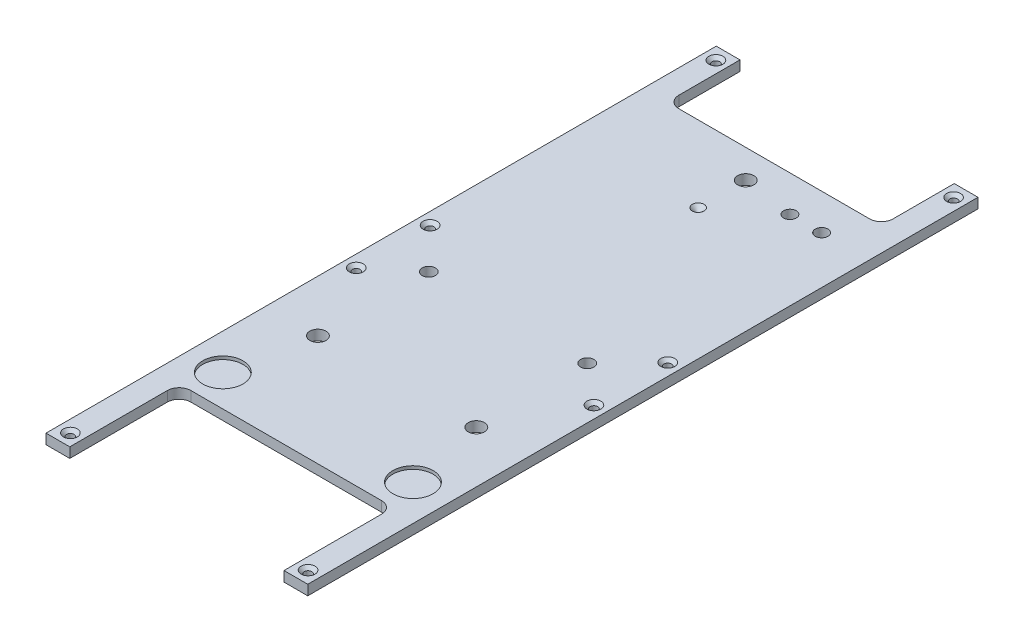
ISO-10303-21;
HEADER;
FILE_DESCRIPTION(('STEP AP214'),'2;1');
FILE_NAME('part.step','',(''),(''),'','','');
FILE_SCHEMA(('AUTOMOTIVE_DESIGN { 1 0 10303 214 1 1 1 1 }'));
ENDSEC;
DATA;
#1=APPLICATION_CONTEXT('core data for automotive mechanical design processes');
#2=APPLICATION_PROTOCOL_DEFINITION('international standard','automotive_design',2000,#1);
#3=PRODUCT_CONTEXT('',#1,'mechanical');
#4=PRODUCT('Part','Part','',(#3));
#5=PRODUCT_RELATED_PRODUCT_CATEGORY('part','',(#4));
#6=PRODUCT_DEFINITION_FORMATION('','',#4);
#7=PRODUCT_DEFINITION_CONTEXT('part definition',#1,'design');
#8=PRODUCT_DEFINITION('design','',#6,#7);
#9=PRODUCT_DEFINITION_SHAPE('','',#8);
#10=(LENGTH_UNIT() NAMED_UNIT(*) SI_UNIT(.MILLI.,.METRE.));
#11=(NAMED_UNIT(*) PLANE_ANGLE_UNIT() SI_UNIT($,.RADIAN.));
#12=(NAMED_UNIT(*) SI_UNIT($,.STERADIAN.) SOLID_ANGLE_UNIT());
#13=UNCERTAINTY_MEASURE_WITH_UNIT(LENGTH_MEASURE(1.E-05),#10,'distance_accuracy_value','');
#14=(GEOMETRIC_REPRESENTATION_CONTEXT(3) GLOBAL_UNCERTAINTY_ASSIGNED_CONTEXT((#13)) GLOBAL_UNIT_ASSIGNED_CONTEXT((#10,
#11,#12)) REPRESENTATION_CONTEXT('',''));
#15=CARTESIAN_POINT('',(0.,0.,0.));
#16=DIRECTION('',(0.,0.,1.));
#17=DIRECTION('',(1.,0.,0.));
#18=AXIS2_PLACEMENT_3D('',#15,#16,#17);
#19=CARTESIAN_POINT('',(0.,3.175,0.));
#20=DIRECTION('',(0.,1.,0.));
#21=DIRECTION('',(0.,0.,1.));
#22=AXIS2_PLACEMENT_3D('',#19,#20,#21);
#23=PLANE('',#22);
#24=CARTESIAN_POINT('',(16.3,3.175,-12.65));
#25=DIRECTION('',(0.,1.,0.));
#26=DIRECTION('',(0.,0.,1.));
#27=AXIS2_PLACEMENT_3D('',#24,#25,#26);
#28=CIRCLE('',#27,2.);
#29=CARTESIAN_POINT('',(16.3,3.175,-10.65));
#30=VERTEX_POINT('',#29);
#31=EDGE_CURVE('E456',#30,#30,#28,.T.);
#32=ORIENTED_EDGE('',*,*,#31,.F.);
#33=EDGE_LOOP('',(#32));
#34=FACE_BOUND('',#33,.T.);
#35=CARTESIAN_POINT('',(26.3,3.175,-12.65));
#36=DIRECTION('',(0.,1.,0.));
#37=DIRECTION('',(0.,0.,1.));
#38=AXIS2_PLACEMENT_3D('',#35,#36,#37);
#39=CIRCLE('',#38,2.);
#40=CARTESIAN_POINT('',(26.3,3.175,-10.65));
#41=VERTEX_POINT('',#40);
#42=EDGE_CURVE('E450',#41,#41,#39,.T.);
#43=ORIENTED_EDGE('',*,*,#42,.F.);
#44=EDGE_LOOP('',(#43));
#45=FACE_BOUND('',#44,.T.);
#46=CARTESIAN_POINT('',(-25.,3.175,60.));
#47=DIRECTION('',(0.,1.,0.));
#48=DIRECTION('',(0.,0.,1.));
#49=AXIS2_PLACEMENT_3D('',#46,#47,#48);
#50=CIRCLE('',#49,2.09999999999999);
#51=CARTESIAN_POINT('',(-25.,3.175,62.1));
#52=VERTEX_POINT('',#51);
#53=EDGE_CURVE('E444',#52,#52,#50,.T.);
#54=ORIENTED_EDGE('',*,*,#53,.F.);
#55=EDGE_LOOP('',(#54));
#56=FACE_BOUND('',#55,.T.);
#57=CARTESIAN_POINT('',(25.,3.175,60.));
#58=DIRECTION('',(0.,1.,0.));
#59=DIRECTION('',(0.,0.,1.));
#60=AXIS2_PLACEMENT_3D('',#57,#58,#59);
#61=CIRCLE('',#60,2.09999999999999);
#62=CARTESIAN_POINT('',(25.,3.175,62.1));
#63=VERTEX_POINT('',#62);
#64=EDGE_CURVE('E438',#63,#63,#61,.T.);
#65=ORIENTED_EDGE('',*,*,#64,.F.);
#66=EDGE_LOOP('',(#65));
#67=FACE_BOUND('',#66,.T.);
#68=CARTESIAN_POINT('',(-25.,3.175,95.));
#69=DIRECTION('',(0.,1.,0.));
#70=DIRECTION('',(0.,0.,1.));
#71=AXIS2_PLACEMENT_3D('',#68,#69,#70);
#72=CIRCLE('',#71,2.5527);
#73=CARTESIAN_POINT('',(-25.,3.175,97.5527));
#74=VERTEX_POINT('',#73);
#75=EDGE_CURVE('E432',#74,#74,#72,.T.);
#76=ORIENTED_EDGE('',*,*,#75,.F.);
#77=EDGE_LOOP('',(#76));
#78=FACE_BOUND('',#77,.T.);
#79=CARTESIAN_POINT('',(25.,3.175,95.));
#80=DIRECTION('',(0.,1.,0.));
#81=DIRECTION('',(0.,0.,1.));
#82=AXIS2_PLACEMENT_3D('',#79,#80,#81);
#83=CIRCLE('',#82,2.5527);
#84=CARTESIAN_POINT('',(25.,3.175,97.5527));
#85=VERTEX_POINT('',#84);
#86=EDGE_CURVE('E426',#85,#85,#83,.T.);
#87=ORIENTED_EDGE('',*,*,#86,.F.);
#88=EDGE_LOOP('',(#87));
#89=FACE_BOUND('',#88,.T.);
#90=CARTESIAN_POINT('',(0.,3.175,-15.));
#91=DIRECTION('',(0.,1.,0.));
#92=DIRECTION('',(0.,0.,1.));
#93=AXIS2_PLACEMENT_3D('',#90,#91,#92);
#94=CIRCLE('',#93,2.5527);
#95=CARTESIAN_POINT('',(0.,3.175,-12.4473));
#96=VERTEX_POINT('',#95);
#97=EDGE_CURVE('E420',#96,#96,#94,.T.);
#98=ORIENTED_EDGE('',*,*,#97,.F.);
#99=EDGE_LOOP('',(#98));
#100=FACE_BOUND('',#99,.T.);
#101=CARTESIAN_POINT('',(30.,3.175,120.));
#102=DIRECTION('',(0.,1.,0.));
#103=DIRECTION('',(0.,0.,1.));
#104=AXIS2_PLACEMENT_3D('',#101,#102,#103);
#105=CIRCLE('',#104,6.35000000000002);
#106=CARTESIAN_POINT('',(30.,3.175,126.35));
#107=VERTEX_POINT('',#106);
#108=EDGE_CURVE('E412',#107,#107,#105,.T.);
#109=ORIENTED_EDGE('',*,*,#108,.F.);
#110=EDGE_LOOP('',(#109));
#111=FACE_BOUND('',#110,.T.);
#112=CARTESIAN_POINT('',(-30.,3.175,120.));
#113=DIRECTION('',(0.,1.,0.));
#114=DIRECTION('',(0.,0.,1.));
#115=AXIS2_PLACEMENT_3D('',#112,#113,#114);
#116=CIRCLE('',#115,6.35000000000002);
#117=CARTESIAN_POINT('',(-30.,3.175,126.35));
#118=VERTEX_POINT('',#117);
#119=EDGE_CURVE('E406',#118,#118,#116,.T.);
#120=ORIENTED_EDGE('',*,*,#119,.F.);
#121=EDGE_LOOP('',(#120));
#122=FACE_BOUND('',#121,.T.);
#123=CARTESIAN_POINT('',(-37.4999999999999,3.175,-43.1));
#124=DIRECTION('',(0.,1.,0.));
#125=DIRECTION('',(0.,0.,1.));
#126=AXIS2_PLACEMENT_3D('',#123,#124,#125);
#127=CIRCLE('',#126,2.2);
#128=CARTESIAN_POINT('',(-37.4999999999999,3.175,-40.9));
#129=VERTEX_POINT('',#128);
#130=EDGE_CURVE('E402',#129,#129,#127,.T.);
#131=ORIENTED_EDGE('',*,*,#130,.F.);
#132=EDGE_LOOP('',(#131));
#133=FACE_BOUND('',#132,.T.);
#134=CARTESIAN_POINT('',(37.4999999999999,3.175,-43.1));
#135=DIRECTION('',(0.,1.,0.));
#136=DIRECTION('',(0.,0.,1.));
#137=AXIS2_PLACEMENT_3D('',#134,#135,#136);
#138=CIRCLE('',#137,2.2);
#139=CARTESIAN_POINT('',(37.4999999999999,3.175,-40.9));
#140=VERTEX_POINT('',#139);
#141=EDGE_CURVE('E393',#140,#140,#138,.T.);
#142=ORIENTED_EDGE('',*,*,#141,.F.);
#143=EDGE_LOOP('',(#142));
#144=FACE_BOUND('',#143,.T.);
#145=CARTESIAN_POINT('',(37.4999999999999,3.175,47.1));
#146=DIRECTION('',(0.,1.,0.));
#147=DIRECTION('',(0.,0.,1.));
#148=AXIS2_PLACEMENT_3D('',#145,#146,#147);
#149=CIRCLE('',#148,2.2);
#150=CARTESIAN_POINT('',(37.4999999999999,3.175,49.3));
#151=VERTEX_POINT('',#150);
#152=EDGE_CURVE('E384',#151,#151,#149,.T.);
#153=ORIENTED_EDGE('',*,*,#152,.F.);
#154=EDGE_LOOP('',(#153));
#155=FACE_BOUND('',#154,.T.);
#156=CARTESIAN_POINT('',(-37.4999999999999,3.175,47.1));
#157=DIRECTION('',(0.,1.,0.));
#158=DIRECTION('',(0.,0.,1.));
#159=AXIS2_PLACEMENT_3D('',#156,#157,#158);
#160=CIRCLE('',#159,2.2);
#161=CARTESIAN_POINT('',(-37.4999999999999,3.175,49.3));
#162=VERTEX_POINT('',#161);
#163=EDGE_CURVE('E375',#162,#162,#160,.T.);
#164=ORIENTED_EDGE('',*,*,#163,.F.);
#165=EDGE_LOOP('',(#164));
#166=FACE_BOUND('',#165,.T.);
#167=CARTESIAN_POINT('',(-37.4999999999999,3.175,70.4));
#168=DIRECTION('',(0.,1.,0.));
#169=DIRECTION('',(0.,0.,1.));
#170=AXIS2_PLACEMENT_3D('',#167,#168,#169);
#171=CIRCLE('',#170,2.2);
#172=CARTESIAN_POINT('',(-37.4999999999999,3.175,72.6));
#173=VERTEX_POINT('',#172);
#174=EDGE_CURVE('E366',#173,#173,#171,.T.);
#175=ORIENTED_EDGE('',*,*,#174,.F.);
#176=EDGE_LOOP('',(#175));
#177=FACE_BOUND('',#176,.T.);
#178=CARTESIAN_POINT('',(37.4999999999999,3.175,70.4));
#179=DIRECTION('',(0.,1.,0.));
#180=DIRECTION('',(0.,0.,1.));
#181=AXIS2_PLACEMENT_3D('',#178,#179,#180);
#182=CIRCLE('',#181,2.2);
#183=CARTESIAN_POINT('',(37.4999999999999,3.175,72.6));
#184=VERTEX_POINT('',#183);
#185=EDGE_CURVE('E357',#184,#184,#182,.T.);
#186=ORIENTED_EDGE('',*,*,#185,.F.);
#187=EDGE_LOOP('',(#186));
#188=FACE_BOUND('',#187,.T.);
#189=CARTESIAN_POINT('',(-37.4999999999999,3.175,160.6));
#190=DIRECTION('',(0.,1.,0.));
#191=DIRECTION('',(0.,0.,1.));
#192=AXIS2_PLACEMENT_3D('',#189,#190,#191);
#193=CIRCLE('',#192,2.2);
#194=CARTESIAN_POINT('',(-37.4999999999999,3.175,162.8));
#195=VERTEX_POINT('',#194);
#196=EDGE_CURVE('E348',#195,#195,#193,.T.);
#197=ORIENTED_EDGE('',*,*,#196,.F.);
#198=EDGE_LOOP('',(#197));
#199=FACE_BOUND('',#198,.T.);
#200=CARTESIAN_POINT('',(37.5000000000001,3.175,160.6));
#201=DIRECTION('',(0.,1.,0.));
#202=DIRECTION('',(0.,0.,1.));
#203=AXIS2_PLACEMENT_3D('',#200,#201,#202);
#204=CIRCLE('',#203,2.2);
#205=CARTESIAN_POINT('',(37.5000000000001,3.175,162.8));
#206=VERTEX_POINT('',#205);
#207=EDGE_CURVE('E339',#206,#206,#204,.T.);
#208=ORIENTED_EDGE('',*,*,#207,.F.);
#209=EDGE_LOOP('',(#208));
#210=FACE_BOUND('',#209,.T.);
#211=DIRECTION('',(0.,0.,-1.));
#212=VECTOR('',#211,1.);
#213=CARTESIAN_POINT('',(41.3,3.175,-24.));
#214=LINE('',#213,#212);
#215=CARTESIAN_POINT('',(41.3,3.175,164.5));
#216=VERTEX_POINT('',#215);
#217=CARTESIAN_POINT('',(41.3,3.175,-47.));
#218=VERTEX_POINT('',#217);
#219=EDGE_CURVE('E258',#216,#218,#214,.T.);
#220=ORIENTED_EDGE('',*,*,#219,.T.);
#221=DIRECTION('',(1.,0.,0.));
#222=VECTOR('',#221,1.);
#223=CARTESIAN_POINT('',(33.8,3.175,-47.));
#224=LINE('',#223,#222);
#225=CARTESIAN_POINT('',(33.8,3.175,-47.));
#226=VERTEX_POINT('',#225);
#227=EDGE_CURVE('E288',#226,#218,#224,.T.);
#228=ORIENTED_EDGE('',*,*,#227,.F.);
#229=DIRECTION('',(0.,0.,-1.));
#230=VECTOR('',#229,1.);
#231=CARTESIAN_POINT('',(33.8,3.175,-24.));
#232=LINE('',#231,#230);
#233=CARTESIAN_POINT('',(33.8,3.175,-27.7));
#234=VERTEX_POINT('',#233);
#235=EDGE_CURVE('E289',#234,#226,#232,.T.);
#236=ORIENTED_EDGE('',*,*,#235,.F.);
#237=CARTESIAN_POINT('',(30.1,3.175,-27.7));
#238=DIRECTION('',(0.,1.,0.));
#239=DIRECTION('',(0.,0.,1.));
#240=AXIS2_PLACEMENT_3D('',#237,#238,#239);
#241=CIRCLE('',#240,3.7);
#242=CARTESIAN_POINT('',(30.1,3.175,-24.));
#243=VERTEX_POINT('',#242);
#244=EDGE_CURVE('E11',#234,#243,#241,.F.);
#245=ORIENTED_EDGE('',*,*,#244,.T.);
#246=DIRECTION('',(-1.,0.,0.));
#247=VECTOR('',#246,1.);
#248=CARTESIAN_POINT('',(-41.3,3.175,-24.));
#249=LINE('',#248,#247);
#250=CARTESIAN_POINT('',(-30.1,3.175,-24.));
#251=VERTEX_POINT('',#250);
#252=EDGE_CURVE('E241',#243,#251,#249,.T.);
#253=ORIENTED_EDGE('',*,*,#252,.T.);
#254=CARTESIAN_POINT('',(-30.1,3.175,-27.7));
#255=DIRECTION('',(0.,1.,0.));
#256=DIRECTION('',(0.,0.,1.));
#257=AXIS2_PLACEMENT_3D('',#254,#255,#256);
#258=CIRCLE('',#257,3.7);
#259=CARTESIAN_POINT('',(-33.8,3.175,-27.7));
#260=VERTEX_POINT('',#259);
#261=EDGE_CURVE('E211',#251,#260,#258,.F.);
#262=ORIENTED_EDGE('',*,*,#261,.T.);
#263=DIRECTION('',(0.,0.,1.));
#264=VECTOR('',#263,1.);
#265=CARTESIAN_POINT('',(-33.8,3.175,-47.));
#266=LINE('',#265,#264);
#267=CARTESIAN_POINT('',(-33.8,3.175,-47.));
#268=VERTEX_POINT('',#267);
#269=EDGE_CURVE('E278',#268,#260,#266,.T.);
#270=ORIENTED_EDGE('',*,*,#269,.F.);
#271=DIRECTION('',(1.,0.,0.));
#272=VECTOR('',#271,1.);
#273=CARTESIAN_POINT('',(-41.3,3.175,-47.));
#274=LINE('',#273,#272);
#275=CARTESIAN_POINT('',(-41.3,3.175,-47.));
#276=VERTEX_POINT('',#275);
#277=EDGE_CURVE('E275',#276,#268,#274,.T.);
#278=ORIENTED_EDGE('',*,*,#277,.F.);
#279=DIRECTION('',(0.,0.,1.));
#280=VECTOR('',#279,1.);
#281=CARTESIAN_POINT('',(-41.3,3.175,-24.));
#282=LINE('',#281,#280);
#283=CARTESIAN_POINT('',(-41.3,3.175,164.5));
#284=VERTEX_POINT('',#283);
#285=EDGE_CURVE('E264',#276,#284,#282,.T.);
#286=ORIENTED_EDGE('',*,*,#285,.T.);
#287=DIRECTION('',(-1.,0.,0.));
#288=VECTOR('',#287,1.);
#289=CARTESIAN_POINT('',(-41.3,3.175,164.5));
#290=LINE('',#289,#288);
#291=CARTESIAN_POINT('',(-33.8,3.175,164.5));
#292=VERTEX_POINT('',#291);
#293=EDGE_CURVE('E304',#292,#284,#290,.T.);
#294=ORIENTED_EDGE('',*,*,#293,.F.);
#295=DIRECTION('',(0.,0.,1.));
#296=VECTOR('',#295,1.);
#297=CARTESIAN_POINT('',(-33.8,3.175,130.));
#298=LINE('',#297,#296);
#299=CARTESIAN_POINT('',(-33.8,3.175,133.7));
#300=VERTEX_POINT('',#299);
#301=EDGE_CURVE('E305',#300,#292,#298,.T.);
#302=ORIENTED_EDGE('',*,*,#301,.F.);
#303=CARTESIAN_POINT('',(-30.1,3.175,133.7));
#304=DIRECTION('',(0.,1.,0.));
#305=DIRECTION('',(0.,0.,1.));
#306=AXIS2_PLACEMENT_3D('',#303,#304,#305);
#307=CIRCLE('',#306,3.7);
#308=CARTESIAN_POINT('',(-30.1,3.175,130.));
#309=VERTEX_POINT('',#308);
#310=EDGE_CURVE('E220',#300,#309,#307,.F.);
#311=ORIENTED_EDGE('',*,*,#310,.T.);
#312=DIRECTION('',(1.,0.,0.));
#313=VECTOR('',#312,1.);
#314=CARTESIAN_POINT('',(-41.3,3.175,130.));
#315=LINE('',#314,#313);
#316=CARTESIAN_POINT('',(30.1,3.175,130.));
#317=VERTEX_POINT('',#316);
#318=EDGE_CURVE('E261',#309,#317,#315,.T.);
#319=ORIENTED_EDGE('',*,*,#318,.T.);
#320=CARTESIAN_POINT('',(30.1,3.175,133.7));
#321=DIRECTION('',(0.,1.,0.));
#322=DIRECTION('',(0.,0.,1.));
#323=AXIS2_PLACEMENT_3D('',#320,#321,#322);
#324=CIRCLE('',#323,3.7);
#325=CARTESIAN_POINT('',(33.8,3.175,133.7));
#326=VERTEX_POINT('',#325);
#327=EDGE_CURVE('E226',#317,#326,#324,.F.);
#328=ORIENTED_EDGE('',*,*,#327,.T.);
#329=DIRECTION('',(0.,0.,-1.));
#330=VECTOR('',#329,1.);
#331=CARTESIAN_POINT('',(33.8,3.175,130.));
#332=LINE('',#331,#330);
#333=CARTESIAN_POINT('',(33.8,3.175,164.5));
#334=VERTEX_POINT('',#333);
#335=EDGE_CURVE('E317',#334,#326,#332,.T.);
#336=ORIENTED_EDGE('',*,*,#335,.F.);
#337=DIRECTION('',(-1.,0.,0.));
#338=VECTOR('',#337,1.);
#339=CARTESIAN_POINT('',(41.3,3.175,164.5));
#340=LINE('',#339,#338);
#341=EDGE_CURVE('E320',#216,#334,#340,.T.);
#342=ORIENTED_EDGE('',*,*,#341,.F.);
#343=EDGE_LOOP('',(#220,#228,#236,#245,#253,#262,#270,#278,#286,#294,#302,#311,#319,#328,#336,#342));
#344=FACE_BOUND('',#343,.T.);
#345=CARTESIAN_POINT('',(0.,3.17499999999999,0.));
#346=DIRECTION('',(0.,1.,0.));
#347=DIRECTION('',(-1.,0.,0.));
#348=AXIS2_PLACEMENT_3D('',#345,#346,#347);
#349=CIRCLE('',#348,1.85000000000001);
#350=CARTESIAN_POINT('',(-1.85000000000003,3.17499999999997,0.));
#351=VERTEX_POINT('',#350);
#352=EDGE_CURVE('E329',#351,#351,#349,.T.);
#353=ORIENTED_EDGE('',*,*,#352,.F.);
#354=EDGE_LOOP('',(#353));
#355=FACE_BOUND('',#354,.T.);
#356=ADVANCED_FACE('F37',(#34,#45,#56,#67,#78,#89,#100,#111,#122,#133,#144,#155,#166,#177,#188,
#199,#210,#344,#355),#23,.T.);
#357=CARTESIAN_POINT('',(-41.3,3.175,-24.));
#358=DIRECTION('',(0.,0.,1.));
#359=DIRECTION('',(1.,0.,0.));
#360=AXIS2_PLACEMENT_3D('',#357,#358,#359);
#361=PLANE('',#360);
#362=DIRECTION('',(-1.,0.,0.));
#363=VECTOR('',#362,1.);
#364=CARTESIAN_POINT('',(-41.3,0.,-24.));
#365=LINE('',#364,#363);
#366=CARTESIAN_POINT('',(30.1,0.,-24.));
#367=VERTEX_POINT('',#366);
#368=CARTESIAN_POINT('',(-30.1,0.,-24.));
#369=VERTEX_POINT('',#368);
#370=EDGE_CURVE('E235',#367,#369,#365,.T.);
#371=ORIENTED_EDGE('',*,*,#370,.T.);
#372=DIRECTION('',(0.,-1.,0.));
#373=VECTOR('',#372,1.);
#374=CARTESIAN_POINT('',(-30.1,3.175,-24.));
#375=LINE('',#374,#373);
#376=EDGE_CURVE('E212',#369,#251,#375,.F.);
#377=ORIENTED_EDGE('',*,*,#376,.T.);
#378=ORIENTED_EDGE('',*,*,#252,.F.);
#379=DIRECTION('',(0.,-1.,0.));
#380=VECTOR('',#379,1.);
#381=CARTESIAN_POINT('',(30.1,3.175,-24.));
#382=LINE('',#381,#380);
#383=EDGE_CURVE('E232',#243,#367,#382,.T.);
#384=ORIENTED_EDGE('',*,*,#383,.T.);
#385=EDGE_LOOP('',(#371,#377,#378,#384));
#386=FACE_BOUND('',#385,.T.);
#387=ADVANCED_FACE('F166',(#386),#361,.F.);
#388=CARTESIAN_POINT('',(41.3,3.175,-24.));
#389=DIRECTION('',(-1.,0.,0.));
#390=DIRECTION('',(0.,0.,1.));
#391=AXIS2_PLACEMENT_3D('',#388,#389,#390);
#392=PLANE('',#391);
#393=DIRECTION('',(0.,0.,-1.));
#394=VECTOR('',#393,1.);
#395=CARTESIAN_POINT('',(41.3,0.,-24.));
#396=LINE('',#395,#394);
#397=CARTESIAN_POINT('',(41.3,0.,164.5));
#398=VERTEX_POINT('',#397);
#399=CARTESIAN_POINT('',(41.3,0.,-47.));
#400=VERTEX_POINT('',#399);
#401=EDGE_CURVE('E240',#398,#400,#396,.T.);
#402=ORIENTED_EDGE('',*,*,#401,.T.);
#403=DIRECTION('',(0.,-1.,0.));
#404=VECTOR('',#403,1.);
#405=CARTESIAN_POINT('',(41.3,38.4808068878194,-47.));
#406=LINE('',#405,#404);
#407=EDGE_CURVE('E284',#218,#400,#406,.T.);
#408=ORIENTED_EDGE('',*,*,#407,.F.);
#409=ORIENTED_EDGE('',*,*,#219,.F.);
#410=DIRECTION('',(0.,-1.,0.));
#411=VECTOR('',#410,1.);
#412=CARTESIAN_POINT('',(41.3,38.4808068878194,164.5));
#413=LINE('',#412,#411);
#414=EDGE_CURVE('E314',#216,#398,#413,.T.);
#415=ORIENTED_EDGE('',*,*,#414,.T.);
#416=EDGE_LOOP('',(#402,#408,#409,#415));
#417=FACE_BOUND('',#416,.T.);
#418=ADVANCED_FACE('F172',(#417),#392,.F.);
#419=CARTESIAN_POINT('',(-41.3,3.175,-24.));
#420=DIRECTION('',(1.,0.,0.));
#421=DIRECTION('',(0.,0.,-1.));
#422=AXIS2_PLACEMENT_3D('',#419,#420,#421);
#423=PLANE('',#422);
#424=DIRECTION('',(0.,0.,1.));
#425=VECTOR('',#424,1.);
#426=CARTESIAN_POINT('',(-41.3,0.,-24.));
#427=LINE('',#426,#425);
#428=CARTESIAN_POINT('',(-41.3,0.,-47.));
#429=VERTEX_POINT('',#428);
#430=CARTESIAN_POINT('',(-41.3,0.,164.5));
#431=VERTEX_POINT('',#430);
#432=EDGE_CURVE('E239',#429,#431,#427,.T.);
#433=ORIENTED_EDGE('',*,*,#432,.T.);
#434=DIRECTION('',(0.,-1.,0.));
#435=VECTOR('',#434,1.);
#436=CARTESIAN_POINT('',(-41.3,38.4808068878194,164.5));
#437=LINE('',#436,#435);
#438=EDGE_CURVE('E298',#284,#431,#437,.T.);
#439=ORIENTED_EDGE('',*,*,#438,.F.);
#440=ORIENTED_EDGE('',*,*,#285,.F.);
#441=DIRECTION('',(0.,-1.,0.));
#442=VECTOR('',#441,1.);
#443=CARTESIAN_POINT('',(-41.3,38.4808068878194,-47.));
#444=LINE('',#443,#442);
#445=EDGE_CURVE('E272',#276,#429,#444,.T.);
#446=ORIENTED_EDGE('',*,*,#445,.T.);
#447=EDGE_LOOP('',(#433,#439,#440,#446));
#448=FACE_BOUND('',#447,.T.);
#449=ADVANCED_FACE('F188',(#448),#423,.F.);
#450=CARTESIAN_POINT('',(-41.3,3.175,130.));
#451=DIRECTION('',(0.,0.,-1.));
#452=DIRECTION('',(-1.,0.,0.));
#453=AXIS2_PLACEMENT_3D('',#450,#451,#452);
#454=PLANE('',#453);
#455=DIRECTION('',(1.,0.,0.));
#456=VECTOR('',#455,1.);
#457=CARTESIAN_POINT('',(-41.3,0.,130.));
#458=LINE('',#457,#456);
#459=CARTESIAN_POINT('',(-30.1,0.,130.));
#460=VERTEX_POINT('',#459);
#461=CARTESIAN_POINT('',(30.1,0.,130.));
#462=VERTEX_POINT('',#461);
#463=EDGE_CURVE('E249',#460,#462,#458,.T.);
#464=ORIENTED_EDGE('',*,*,#463,.T.);
#465=DIRECTION('',(0.,-1.,0.));
#466=VECTOR('',#465,1.);
#467=CARTESIAN_POINT('',(30.1,3.175,130.));
#468=LINE('',#467,#466);
#469=EDGE_CURVE('E509',#462,#317,#468,.F.);
#470=ORIENTED_EDGE('',*,*,#469,.T.);
#471=ORIENTED_EDGE('',*,*,#318,.F.);
#472=DIRECTION('',(0.,-1.,0.));
#473=VECTOR('',#472,1.);
#474=CARTESIAN_POINT('',(-30.1,3.175,130.));
#475=LINE('',#474,#473);
#476=EDGE_CURVE('E265',#309,#460,#475,.T.);
#477=ORIENTED_EDGE('',*,*,#476,.T.);
#478=EDGE_LOOP('',(#464,#470,#471,#477));
#479=FACE_BOUND('',#478,.T.);
#480=ADVANCED_FACE('F184',(#479),#454,.F.);
#481=CARTESIAN_POINT('',(0.,0.,0.));
#482=DIRECTION('',(0.,1.,0.));
#483=DIRECTION('',(0.,0.,1.));
#484=AXIS2_PLACEMENT_3D('',#481,#482,#483);
#485=PLANE('',#484);
#486=CARTESIAN_POINT('',(16.3,0.,-12.65));
#487=DIRECTION('',(0.,1.,0.));
#488=DIRECTION('',(0.,0.,1.));
#489=AXIS2_PLACEMENT_3D('',#486,#487,#488);
#490=CIRCLE('',#489,2.);
#491=CARTESIAN_POINT('',(16.3,0.,-10.65));
#492=VERTEX_POINT('',#491);
#493=EDGE_CURVE('E453',#492,#492,#490,.F.);
#494=ORIENTED_EDGE('',*,*,#493,.F.);
#495=EDGE_LOOP('',(#494));
#496=FACE_BOUND('',#495,.T.);
#497=CARTESIAN_POINT('',(26.3,0.,-12.65));
#498=DIRECTION('',(0.,1.,0.));
#499=DIRECTION('',(0.,0.,1.));
#500=AXIS2_PLACEMENT_3D('',#497,#498,#499);
#501=CIRCLE('',#500,2.);
#502=CARTESIAN_POINT('',(26.3,0.,-10.65));
#503=VERTEX_POINT('',#502);
#504=EDGE_CURVE('E447',#503,#503,#501,.F.);
#505=ORIENTED_EDGE('',*,*,#504,.F.);
#506=EDGE_LOOP('',(#505));
#507=FACE_BOUND('',#506,.T.);
#508=CARTESIAN_POINT('',(-25.,0.,60.));
#509=DIRECTION('',(0.,1.,0.));
#510=DIRECTION('',(0.,0.,1.));
#511=AXIS2_PLACEMENT_3D('',#508,#509,#510);
#512=CIRCLE('',#511,2.1);
#513=CARTESIAN_POINT('',(-25.,0.,62.1));
#514=VERTEX_POINT('',#513);
#515=EDGE_CURVE('E441',#514,#514,#512,.T.);
#516=ORIENTED_EDGE('',*,*,#515,.T.);
#517=EDGE_LOOP('',(#516));
#518=FACE_BOUND('',#517,.T.);
#519=CARTESIAN_POINT('',(25.,0.,60.));
#520=DIRECTION('',(0.,1.,0.));
#521=DIRECTION('',(0.,0.,1.));
#522=AXIS2_PLACEMENT_3D('',#519,#520,#521);
#523=CIRCLE('',#522,2.1);
#524=CARTESIAN_POINT('',(25.,0.,62.1));
#525=VERTEX_POINT('',#524);
#526=EDGE_CURVE('E435',#525,#525,#523,.T.);
#527=ORIENTED_EDGE('',*,*,#526,.T.);
#528=EDGE_LOOP('',(#527));
#529=FACE_BOUND('',#528,.T.);
#530=CARTESIAN_POINT('',(-25.,0.,95.));
#531=DIRECTION('',(0.,1.,0.));
#532=DIRECTION('',(0.,0.,1.));
#533=AXIS2_PLACEMENT_3D('',#530,#531,#532);
#534=CIRCLE('',#533,2.5527);
#535=CARTESIAN_POINT('',(-25.,0.,97.5527));
#536=VERTEX_POINT('',#535);
#537=EDGE_CURVE('E429',#536,#536,#534,.T.);
#538=ORIENTED_EDGE('',*,*,#537,.T.);
#539=EDGE_LOOP('',(#538));
#540=FACE_BOUND('',#539,.T.);
#541=CARTESIAN_POINT('',(25.,0.,95.));
#542=DIRECTION('',(0.,1.,0.));
#543=DIRECTION('',(0.,0.,1.));
#544=AXIS2_PLACEMENT_3D('',#541,#542,#543);
#545=CIRCLE('',#544,2.5527);
#546=CARTESIAN_POINT('',(25.,0.,97.5527));
#547=VERTEX_POINT('',#546);
#548=EDGE_CURVE('E423',#547,#547,#545,.T.);
#549=ORIENTED_EDGE('',*,*,#548,.T.);
#550=EDGE_LOOP('',(#549));
#551=FACE_BOUND('',#550,.T.);
#552=CARTESIAN_POINT('',(0.,0.,-15.));
#553=DIRECTION('',(0.,1.,0.));
#554=DIRECTION('',(0.,0.,1.));
#555=AXIS2_PLACEMENT_3D('',#552,#553,#554);
#556=CIRCLE('',#555,2.5527);
#557=CARTESIAN_POINT('',(0.,0.,-12.4473));
#558=VERTEX_POINT('',#557);
#559=EDGE_CURVE('E415',#558,#558,#556,.T.);
#560=ORIENTED_EDGE('',*,*,#559,.T.);
#561=EDGE_LOOP('',(#560));
#562=FACE_BOUND('',#561,.T.);
#563=CARTESIAN_POINT('',(-37.4999999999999,0.,-43.1));
#564=DIRECTION('',(0.,1.,0.));
#565=DIRECTION('',(0.,0.,1.));
#566=AXIS2_PLACEMENT_3D('',#563,#564,#565);
#567=CIRCLE('',#566,1.2);
#568=CARTESIAN_POINT('',(-37.4999999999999,0.,-41.9));
#569=VERTEX_POINT('',#568);
#570=EDGE_CURVE('E396',#569,#569,#567,.T.);
#571=ORIENTED_EDGE('',*,*,#570,.T.);
#572=EDGE_LOOP('',(#571));
#573=FACE_BOUND('',#572,.T.);
#574=CARTESIAN_POINT('',(37.4999999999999,0.,-43.1));
#575=DIRECTION('',(0.,1.,0.));
#576=DIRECTION('',(0.,0.,1.));
#577=AXIS2_PLACEMENT_3D('',#574,#575,#576);
#578=CIRCLE('',#577,1.2);
#579=CARTESIAN_POINT('',(37.4999999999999,0.,-41.9));
#580=VERTEX_POINT('',#579);
#581=EDGE_CURVE('E387',#580,#580,#578,.T.);
#582=ORIENTED_EDGE('',*,*,#581,.T.);
#583=EDGE_LOOP('',(#582));
#584=FACE_BOUND('',#583,.T.);
#585=CARTESIAN_POINT('',(37.4999999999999,0.,47.1));
#586=DIRECTION('',(0.,1.,0.));
#587=DIRECTION('',(0.,0.,1.));
#588=AXIS2_PLACEMENT_3D('',#585,#586,#587);
#589=CIRCLE('',#588,1.2);
#590=CARTESIAN_POINT('',(37.4999999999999,0.,48.3));
#591=VERTEX_POINT('',#590);
#592=EDGE_CURVE('E378',#591,#591,#589,.T.);
#593=ORIENTED_EDGE('',*,*,#592,.T.);
#594=EDGE_LOOP('',(#593));
#595=FACE_BOUND('',#594,.T.);
#596=CARTESIAN_POINT('',(-37.4999999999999,0.,47.1));
#597=DIRECTION('',(0.,1.,0.));
#598=DIRECTION('',(0.,0.,1.));
#599=AXIS2_PLACEMENT_3D('',#596,#597,#598);
#600=CIRCLE('',#599,1.2);
#601=CARTESIAN_POINT('',(-37.4999999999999,0.,48.3));
#602=VERTEX_POINT('',#601);
#603=EDGE_CURVE('E369',#602,#602,#600,.T.);
#604=ORIENTED_EDGE('',*,*,#603,.T.);
#605=EDGE_LOOP('',(#604));
#606=FACE_BOUND('',#605,.T.);
#607=CARTESIAN_POINT('',(-37.4999999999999,0.,70.4));
#608=DIRECTION('',(0.,1.,0.));
#609=DIRECTION('',(0.,0.,1.));
#610=AXIS2_PLACEMENT_3D('',#607,#608,#609);
#611=CIRCLE('',#610,1.2);
#612=CARTESIAN_POINT('',(-37.4999999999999,0.,71.6));
#613=VERTEX_POINT('',#612);
#614=EDGE_CURVE('E360',#613,#613,#611,.T.);
#615=ORIENTED_EDGE('',*,*,#614,.T.);
#616=EDGE_LOOP('',(#615));
#617=FACE_BOUND('',#616,.T.);
#618=CARTESIAN_POINT('',(37.4999999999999,0.,70.4));
#619=DIRECTION('',(0.,1.,0.));
#620=DIRECTION('',(0.,0.,1.));
#621=AXIS2_PLACEMENT_3D('',#618,#619,#620);
#622=CIRCLE('',#621,1.2);
#623=CARTESIAN_POINT('',(37.4999999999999,0.,71.6));
#624=VERTEX_POINT('',#623);
#625=EDGE_CURVE('E351',#624,#624,#622,.T.);
#626=ORIENTED_EDGE('',*,*,#625,.T.);
#627=EDGE_LOOP('',(#626));
#628=FACE_BOUND('',#627,.T.);
#629=CARTESIAN_POINT('',(-37.4999999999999,0.,160.6));
#630=DIRECTION('',(0.,1.,0.));
#631=DIRECTION('',(0.,0.,1.));
#632=AXIS2_PLACEMENT_3D('',#629,#630,#631);
#633=CIRCLE('',#632,1.2);
#634=CARTESIAN_POINT('',(-37.4999999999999,0.,161.8));
#635=VERTEX_POINT('',#634);
#636=EDGE_CURVE('E342',#635,#635,#633,.T.);
#637=ORIENTED_EDGE('',*,*,#636,.T.);
#638=EDGE_LOOP('',(#637));
#639=FACE_BOUND('',#638,.T.);
#640=CARTESIAN_POINT('',(37.5000000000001,0.,160.6));
#641=DIRECTION('',(0.,1.,0.));
#642=DIRECTION('',(0.,0.,1.));
#643=AXIS2_PLACEMENT_3D('',#640,#641,#642);
#644=CIRCLE('',#643,1.2);
#645=CARTESIAN_POINT('',(37.5000000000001,0.,161.8));
#646=VERTEX_POINT('',#645);
#647=EDGE_CURVE('E333',#646,#646,#644,.T.);
#648=ORIENTED_EDGE('',*,*,#647,.T.);
#649=EDGE_LOOP('',(#648));
#650=FACE_BOUND('',#649,.T.);
#651=ORIENTED_EDGE('',*,*,#401,.F.);
#652=DIRECTION('',(-1.,0.,0.));
#653=VECTOR('',#652,1.);
#654=CARTESIAN_POINT('',(41.3,0.,164.5));
#655=LINE('',#654,#653);
#656=CARTESIAN_POINT('',(33.8,0.,164.5));
#657=VERTEX_POINT('',#656);
#658=EDGE_CURVE('E326',#398,#657,#655,.T.);
#659=ORIENTED_EDGE('',*,*,#658,.T.);
#660=DIRECTION('',(0.,0.,-1.));
#661=VECTOR('',#660,1.);
#662=CARTESIAN_POINT('',(33.8,0.,130.));
#663=LINE('',#662,#661);
#664=CARTESIAN_POINT('',(33.8,0.,133.7));
#665=VERTEX_POINT('',#664);
#666=EDGE_CURVE('E325',#657,#665,#663,.T.);
#667=ORIENTED_EDGE('',*,*,#666,.T.);
#668=CARTESIAN_POINT('',(30.1,0.,133.7));
#669=DIRECTION('',(0.,1.,0.));
#670=DIRECTION('',(0.,0.,1.));
#671=AXIS2_PLACEMENT_3D('',#668,#669,#670);
#672=CIRCLE('',#671,3.7);
#673=EDGE_CURVE('E228',#665,#462,#672,.T.);
#674=ORIENTED_EDGE('',*,*,#673,.T.);
#675=ORIENTED_EDGE('',*,*,#463,.F.);
#676=CARTESIAN_POINT('',(-30.1,0.,133.7));
#677=DIRECTION('',(0.,1.,0.));
#678=DIRECTION('',(0.,0.,1.));
#679=AXIS2_PLACEMENT_3D('',#676,#677,#678);
#680=CIRCLE('',#679,3.7);
#681=CARTESIAN_POINT('',(-33.8,0.,133.7));
#682=VERTEX_POINT('',#681);
#683=EDGE_CURVE('E224',#460,#682,#680,.T.);
#684=ORIENTED_EDGE('',*,*,#683,.T.);
#685=DIRECTION('',(0.,0.,1.));
#686=VECTOR('',#685,1.);
#687=CARTESIAN_POINT('',(-33.8,0.,130.));
#688=LINE('',#687,#686);
#689=CARTESIAN_POINT('',(-33.8,0.,164.5));
#690=VERTEX_POINT('',#689);
#691=EDGE_CURVE('E313',#682,#690,#688,.T.);
#692=ORIENTED_EDGE('',*,*,#691,.T.);
#693=DIRECTION('',(-1.,0.,0.));
#694=VECTOR('',#693,1.);
#695=CARTESIAN_POINT('',(-41.3,0.,164.5));
#696=LINE('',#695,#694);
#697=EDGE_CURVE('E310',#690,#431,#696,.T.);
#698=ORIENTED_EDGE('',*,*,#697,.T.);
#699=ORIENTED_EDGE('',*,*,#432,.F.);
#700=DIRECTION('',(1.,0.,0.));
#701=VECTOR('',#700,1.);
#702=CARTESIAN_POINT('',(-41.3,0.,-47.));
#703=LINE('',#702,#701);
#704=CARTESIAN_POINT('',(-33.8,0.,-47.));
#705=VERTEX_POINT('',#704);
#706=EDGE_CURVE('E281',#429,#705,#703,.T.);
#707=ORIENTED_EDGE('',*,*,#706,.T.);
#708=DIRECTION('',(0.,0.,1.));
#709=VECTOR('',#708,1.);
#710=CARTESIAN_POINT('',(-33.8,0.,-47.));
#711=LINE('',#710,#709);
#712=CARTESIAN_POINT('',(-33.8,0.,-27.7));
#713=VERTEX_POINT('',#712);
#714=EDGE_CURVE('E252',#705,#713,#711,.T.);
#715=ORIENTED_EDGE('',*,*,#714,.T.);
#716=CARTESIAN_POINT('',(-30.1,0.,-27.7));
#717=DIRECTION('',(0.,1.,0.));
#718=DIRECTION('',(0.,0.,1.));
#719=AXIS2_PLACEMENT_3D('',#716,#717,#718);
#720=CIRCLE('',#719,3.7);
#721=EDGE_CURVE('E218',#713,#369,#720,.T.);
#722=ORIENTED_EDGE('',*,*,#721,.T.);
#723=ORIENTED_EDGE('',*,*,#370,.F.);
#724=CARTESIAN_POINT('',(30.1,0.,-27.7));
#725=DIRECTION('',(0.,1.,0.));
#726=DIRECTION('',(0.,0.,1.));
#727=AXIS2_PLACEMENT_3D('',#724,#725,#726);
#728=CIRCLE('',#727,3.7);
#729=CARTESIAN_POINT('',(33.8,0.,-27.7));
#730=VERTEX_POINT('',#729);
#731=EDGE_CURVE('E45',#367,#730,#728,.T.);
#732=ORIENTED_EDGE('',*,*,#731,.T.);
#733=DIRECTION('',(0.,0.,-1.));
#734=VECTOR('',#733,1.);
#735=CARTESIAN_POINT('',(33.8,0.,-24.));
#736=LINE('',#735,#734);
#737=CARTESIAN_POINT('',(33.8,0.,-47.));
#738=VERTEX_POINT('',#737);
#739=EDGE_CURVE('E296',#730,#738,#736,.T.);
#740=ORIENTED_EDGE('',*,*,#739,.T.);
#741=DIRECTION('',(1.,0.,0.));
#742=VECTOR('',#741,1.);
#743=CARTESIAN_POINT('',(33.8,0.,-47.));
#744=LINE('',#743,#742);
#745=EDGE_CURVE('E293',#738,#400,#744,.T.);
#746=ORIENTED_EDGE('',*,*,#745,.T.);
#747=EDGE_LOOP('',(#651,#659,#667,#674,#675,#684,#692,#698,#699,#707,#715,#722,#723,#732,#740,#746));
#748=FACE_BOUND('',#747,.T.);
#749=ADVANCED_FACE('F181',(#496,#507,#518,#529,#540,#551,#562,#573,#584,#595,#606,#617,#628,
#639,#650,#748),#485,.F.);
#750=CARTESIAN_POINT('',(-41.3,38.4808068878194,-47.));
#751=DIRECTION('',(0.,0.,-1.));
#752=DIRECTION('',(-1.,0.,0.));
#753=AXIS2_PLACEMENT_3D('',#750,#751,#752);
#754=PLANE('',#753);
#755=ORIENTED_EDGE('',*,*,#445,.F.);
#756=ORIENTED_EDGE('',*,*,#277,.T.);
#757=DIRECTION('',(0.,-1.,0.));
#758=VECTOR('',#757,1.);
#759=CARTESIAN_POINT('',(-33.8,38.4808068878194,-47.));
#760=LINE('',#759,#758);
#761=EDGE_CURVE('E276',#268,#705,#760,.T.);
#762=ORIENTED_EDGE('',*,*,#761,.T.);
#763=ORIENTED_EDGE('',*,*,#706,.F.);
#764=EDGE_LOOP('',(#755,#756,#762,#763));
#765=FACE_BOUND('',#764,.T.);
#766=ADVANCED_FACE('F179',(#765),#754,.T.);
#767=CARTESIAN_POINT('',(-33.8,38.4808068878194,-47.));
#768=DIRECTION('',(1.,0.,0.));
#769=DIRECTION('',(0.,0.,-1.));
#770=AXIS2_PLACEMENT_3D('',#767,#768,#769);
#771=PLANE('',#770);
#772=ORIENTED_EDGE('',*,*,#269,.T.);
#773=DIRECTION('',(0.,-1.,0.));
#774=VECTOR('',#773,1.);
#775=CARTESIAN_POINT('',(-33.8,38.4808068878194,-27.7));
#776=LINE('',#775,#774);
#777=EDGE_CURVE('E214',#260,#713,#776,.T.);
#778=ORIENTED_EDGE('',*,*,#777,.T.);
#779=ORIENTED_EDGE('',*,*,#714,.F.);
#780=ORIENTED_EDGE('',*,*,#761,.F.);
#781=EDGE_LOOP('',(#772,#778,#779,#780));
#782=FACE_BOUND('',#781,.T.);
#783=ADVANCED_FACE('F525',(#782),#771,.T.);
#784=CARTESIAN_POINT('',(33.8,38.4808068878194,-24.));
#785=DIRECTION('',(-1.,0.,0.));
#786=DIRECTION('',(0.,0.,1.));
#787=AXIS2_PLACEMENT_3D('',#784,#785,#786);
#788=PLANE('',#787);
#789=ORIENTED_EDGE('',*,*,#739,.F.);
#790=DIRECTION('',(0.,-1.,0.));
#791=VECTOR('',#790,1.);
#792=CARTESIAN_POINT('',(33.8,38.4808068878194,-27.7));
#793=LINE('',#792,#791);
#794=EDGE_CURVE('E58',#730,#234,#793,.F.);
#795=ORIENTED_EDGE('',*,*,#794,.T.);
#796=ORIENTED_EDGE('',*,*,#235,.T.);
#797=DIRECTION('',(0.,-1.,0.));
#798=VECTOR('',#797,1.);
#799=CARTESIAN_POINT('',(33.8,38.4808068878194,-47.));
#800=LINE('',#799,#798);
#801=EDGE_CURVE('E285',#226,#738,#800,.T.);
#802=ORIENTED_EDGE('',*,*,#801,.T.);
#803=EDGE_LOOP('',(#789,#795,#796,#802));
#804=FACE_BOUND('',#803,.T.);
#805=ADVANCED_FACE('F550',(#804),#788,.T.);
#806=CARTESIAN_POINT('',(33.8,38.4808068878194,-47.));
#807=DIRECTION('',(0.,0.,-1.));
#808=DIRECTION('',(-1.,0.,0.));
#809=AXIS2_PLACEMENT_3D('',#806,#807,#808);
#810=PLANE('',#809);
#811=ORIENTED_EDGE('',*,*,#801,.F.);
#812=ORIENTED_EDGE('',*,*,#227,.T.);
#813=ORIENTED_EDGE('',*,*,#407,.T.);
#814=ORIENTED_EDGE('',*,*,#745,.F.);
#815=EDGE_LOOP('',(#811,#812,#813,#814));
#816=FACE_BOUND('',#815,.T.);
#817=ADVANCED_FACE('F552',(#816),#810,.T.);
#818=CARTESIAN_POINT('',(-33.8,38.4808068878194,130.));
#819=DIRECTION('',(1.,0.,0.));
#820=DIRECTION('',(0.,0.,-1.));
#821=AXIS2_PLACEMENT_3D('',#818,#819,#820);
#822=PLANE('',#821);
#823=ORIENTED_EDGE('',*,*,#691,.F.);
#824=DIRECTION('',(0.,-1.,0.));
#825=VECTOR('',#824,1.);
#826=CARTESIAN_POINT('',(-33.8,38.4808068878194,133.7));
#827=LINE('',#826,#825);
#828=EDGE_CURVE('E512',#682,#300,#827,.F.);
#829=ORIENTED_EDGE('',*,*,#828,.T.);
#830=ORIENTED_EDGE('',*,*,#301,.T.);
#831=DIRECTION('',(0.,-1.,0.));
#832=VECTOR('',#831,1.);
#833=CARTESIAN_POINT('',(-33.8,38.4808068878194,164.5));
#834=LINE('',#833,#832);
#835=EDGE_CURVE('E301',#292,#690,#834,.T.);
#836=ORIENTED_EDGE('',*,*,#835,.T.);
#837=EDGE_LOOP('',(#823,#829,#830,#836));
#838=FACE_BOUND('',#837,.T.);
#839=ADVANCED_FACE('F544',(#838),#822,.T.);
#840=CARTESIAN_POINT('',(-41.3,38.4808068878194,164.5));
#841=DIRECTION('',(0.,0.,1.));
#842=DIRECTION('',(1.,0.,0.));
#843=AXIS2_PLACEMENT_3D('',#840,#841,#842);
#844=PLANE('',#843);
#845=ORIENTED_EDGE('',*,*,#835,.F.);
#846=ORIENTED_EDGE('',*,*,#293,.T.);
#847=ORIENTED_EDGE('',*,*,#438,.T.);
#848=ORIENTED_EDGE('',*,*,#697,.F.);
#849=EDGE_LOOP('',(#845,#846,#847,#848));
#850=FACE_BOUND('',#849,.T.);
#851=ADVANCED_FACE('F538',(#850),#844,.T.);
#852=CARTESIAN_POINT('',(41.3,38.4808068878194,164.5));
#853=DIRECTION('',(0.,0.,1.));
#854=DIRECTION('',(1.,0.,0.));
#855=AXIS2_PLACEMENT_3D('',#852,#853,#854);
#856=PLANE('',#855);
#857=ORIENTED_EDGE('',*,*,#414,.F.);
#858=ORIENTED_EDGE('',*,*,#341,.T.);
#859=DIRECTION('',(0.,-1.,0.));
#860=VECTOR('',#859,1.);
#861=CARTESIAN_POINT('',(33.8,38.4808068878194,164.5));
#862=LINE('',#861,#860);
#863=EDGE_CURVE('E318',#334,#657,#862,.T.);
#864=ORIENTED_EDGE('',*,*,#863,.T.);
#865=ORIENTED_EDGE('',*,*,#658,.F.);
#866=EDGE_LOOP('',(#857,#858,#864,#865));
#867=FACE_BOUND('',#866,.T.);
#868=ADVANCED_FACE('F499',(#867),#856,.T.);
#869=CARTESIAN_POINT('',(33.8,38.4808068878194,130.));
#870=DIRECTION('',(-1.,0.,0.));
#871=DIRECTION('',(0.,0.,1.));
#872=AXIS2_PLACEMENT_3D('',#869,#870,#871);
#873=PLANE('',#872);
#874=ORIENTED_EDGE('',*,*,#335,.T.);
#875=DIRECTION('',(0.,-1.,0.));
#876=VECTOR('',#875,1.);
#877=CARTESIAN_POINT('',(33.8,38.4808068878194,133.7));
#878=LINE('',#877,#876);
#879=EDGE_CURVE('E259',#326,#665,#878,.T.);
#880=ORIENTED_EDGE('',*,*,#879,.T.);
#881=ORIENTED_EDGE('',*,*,#666,.F.);
#882=ORIENTED_EDGE('',*,*,#863,.F.);
#883=EDGE_LOOP('',(#874,#880,#881,#882));
#884=FACE_BOUND('',#883,.T.);
#885=ADVANCED_FACE('F200',(#884),#873,.T.);
#886=CARTESIAN_POINT('',(30.1,38.4808068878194,133.7));
#887=DIRECTION('',(0.,-1.,0.));
#888=DIRECTION('',(0.,0.,-1.));
#889=AXIS2_PLACEMENT_3D('',#886,#887,#888);
#890=CYLINDRICAL_SURFACE('',#889,3.7);
#891=ORIENTED_EDGE('',*,*,#327,.F.);
#892=ORIENTED_EDGE('',*,*,#469,.F.);
#893=ORIENTED_EDGE('',*,*,#673,.F.);
#894=ORIENTED_EDGE('',*,*,#879,.F.);
#895=EDGE_LOOP('',(#891,#892,#893,#894));
#896=FACE_BOUND('',#895,.T.);
#897=ADVANCED_FACE('F196',(#896),#890,.F.);
#898=CARTESIAN_POINT('',(-30.1,3.175,133.7));
#899=DIRECTION('',(0.,-1.,0.));
#900=DIRECTION('',(0.,0.,-1.));
#901=AXIS2_PLACEMENT_3D('',#898,#899,#900);
#902=CYLINDRICAL_SURFACE('',#901,3.7);
#903=ORIENTED_EDGE('',*,*,#310,.F.);
#904=ORIENTED_EDGE('',*,*,#828,.F.);
#905=ORIENTED_EDGE('',*,*,#683,.F.);
#906=ORIENTED_EDGE('',*,*,#476,.F.);
#907=EDGE_LOOP('',(#903,#904,#905,#906));
#908=FACE_BOUND('',#907,.T.);
#909=ADVANCED_FACE('F199',(#908),#902,.F.);
#910=CARTESIAN_POINT('',(-30.1,38.4808068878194,-27.7));
#911=DIRECTION('',(0.,-1.,0.));
#912=DIRECTION('',(0.,0.,-1.));
#913=AXIS2_PLACEMENT_3D('',#910,#911,#912);
#914=CYLINDRICAL_SURFACE('',#913,3.7);
#915=ORIENTED_EDGE('',*,*,#261,.F.);
#916=ORIENTED_EDGE('',*,*,#376,.F.);
#917=ORIENTED_EDGE('',*,*,#721,.F.);
#918=ORIENTED_EDGE('',*,*,#777,.F.);
#919=EDGE_LOOP('',(#915,#916,#917,#918));
#920=FACE_BOUND('',#919,.T.);
#921=ADVANCED_FACE('F161',(#920),#914,.F.);
#922=CARTESIAN_POINT('',(30.1,3.175,-27.7));
#923=DIRECTION('',(0.,-1.,0.));
#924=DIRECTION('',(0.,0.,-1.));
#925=AXIS2_PLACEMENT_3D('',#922,#923,#924);
#926=CYLINDRICAL_SURFACE('',#925,3.7);
#927=ORIENTED_EDGE('',*,*,#244,.F.);
#928=ORIENTED_EDGE('',*,*,#794,.F.);
#929=ORIENTED_EDGE('',*,*,#731,.F.);
#930=ORIENTED_EDGE('',*,*,#383,.F.);
#931=EDGE_LOOP('',(#927,#928,#929,#930));
#932=FACE_BOUND('',#931,.T.);
#933=ADVANCED_FACE('F39',(#932),#926,.F.);
#934=CARTESIAN_POINT('',(0.,1.325,0.));
#935=DIRECTION('',(0.,1.,0.));
#936=DIRECTION('',(-1.,0.,0.));
#937=AXIS2_PLACEMENT_3D('',#934,#935,#936);
#938=CONICAL_SURFACE('',#937,0.,0.785398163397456);
#939=ORIENTED_EDGE('',*,*,#352,.T.);
#940=EDGE_LOOP('',(#939));
#941=FACE_BOUND('',#940,.T.);
#942=CARTESIAN_POINT('',(0.,1.325,0.));
#943=VERTEX_POINT('',#942);
#944=VERTEX_LOOP('',#943);
#945=FACE_BOUND('',#944,.T.);
#946=ADVANCED_FACE('F149',(#941,#945),#938,.F.);
#947=CARTESIAN_POINT('',(37.5000000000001,3.175,160.6));
#948=DIRECTION('',(0.,1.,0.));
#949=DIRECTION('',(0.,0.,1.));
#950=AXIS2_PLACEMENT_3D('',#947,#948,#949);
#951=CYLINDRICAL_SURFACE('',#950,1.2);
#952=ORIENTED_EDGE('',*,*,#647,.F.);
#953=EDGE_LOOP('',(#952));
#954=FACE_BOUND('',#953,.T.);
#955=CARTESIAN_POINT('',(37.5000000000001,2.175,160.6));
#956=DIRECTION('',(0.,1.,0.));
#957=DIRECTION('',(0.,0.,1.));
#958=AXIS2_PLACEMENT_3D('',#955,#956,#957);
#959=CIRCLE('',#958,1.2);
#960=CARTESIAN_POINT('',(37.5000000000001,2.175,161.8));
#961=VERTEX_POINT('',#960);
#962=EDGE_CURVE('E336',#961,#961,#959,.T.);
#963=ORIENTED_EDGE('',*,*,#962,.T.);
#964=EDGE_LOOP('',(#963));
#965=FACE_BOUND('',#964,.T.);
#966=ADVANCED_FACE('F151',(#954,#965),#951,.F.);
#967=CARTESIAN_POINT('',(37.5000000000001,3.175,160.6));
#968=DIRECTION('',(0.,1.,0.));
#969=DIRECTION('',(0.,0.,1.));
#970=AXIS2_PLACEMENT_3D('',#967,#968,#969);
#971=CONICAL_SURFACE('',#970,2.2,0.785398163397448);
#972=ORIENTED_EDGE('',*,*,#962,.F.);
#973=EDGE_LOOP('',(#972));
#974=FACE_BOUND('',#973,.T.);
#975=ORIENTED_EDGE('',*,*,#207,.T.);
#976=EDGE_LOOP('',(#975));
#977=FACE_BOUND('',#976,.T.);
#978=ADVANCED_FACE('F158',(#974,#977),#971,.F.);
#979=CARTESIAN_POINT('',(-37.4999999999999,3.175,160.6));
#980=DIRECTION('',(0.,1.,0.));
#981=DIRECTION('',(0.,0.,1.));
#982=AXIS2_PLACEMENT_3D('',#979,#980,#981);
#983=CYLINDRICAL_SURFACE('',#982,1.2);
#984=ORIENTED_EDGE('',*,*,#636,.F.);
#985=EDGE_LOOP('',(#984));
#986=FACE_BOUND('',#985,.T.);
#987=CARTESIAN_POINT('',(-37.4999999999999,2.175,160.6));
#988=DIRECTION('',(0.,1.,0.));
#989=DIRECTION('',(0.,0.,1.));
#990=AXIS2_PLACEMENT_3D('',#987,#988,#989);
#991=CIRCLE('',#990,1.2);
#992=CARTESIAN_POINT('',(-37.4999999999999,2.175,161.8));
#993=VERTEX_POINT('',#992);
#994=EDGE_CURVE('E345',#993,#993,#991,.T.);
#995=ORIENTED_EDGE('',*,*,#994,.T.);
#996=EDGE_LOOP('',(#995));
#997=FACE_BOUND('',#996,.T.);
#998=ADVANCED_FACE('F672',(#986,#997),#983,.F.);
#999=CARTESIAN_POINT('',(-37.4999999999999,3.175,160.6));
#1000=DIRECTION('',(0.,1.,0.));
#1001=DIRECTION('',(0.,0.,1.));
#1002=AXIS2_PLACEMENT_3D('',#999,#1000,#1001);
#1003=CONICAL_SURFACE('',#1002,2.2,0.785398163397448);
#1004=ORIENTED_EDGE('',*,*,#994,.F.);
#1005=EDGE_LOOP('',(#1004));
#1006=FACE_BOUND('',#1005,.T.);
#1007=ORIENTED_EDGE('',*,*,#196,.T.);
#1008=EDGE_LOOP('',(#1007));
#1009=FACE_BOUND('',#1008,.T.);
#1010=ADVANCED_FACE('F682',(#1006,#1009),#1003,.F.);
#1011=CARTESIAN_POINT('',(37.4999999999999,3.175,70.4));
#1012=DIRECTION('',(0.,1.,0.));
#1013=DIRECTION('',(0.,0.,1.));
#1014=AXIS2_PLACEMENT_3D('',#1011,#1012,#1013);
#1015=CYLINDRICAL_SURFACE('',#1014,1.2);
#1016=ORIENTED_EDGE('',*,*,#625,.F.);
#1017=EDGE_LOOP('',(#1016));
#1018=FACE_BOUND('',#1017,.T.);
#1019=CARTESIAN_POINT('',(37.4999999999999,2.175,70.4));
#1020=DIRECTION('',(0.,1.,0.));
#1021=DIRECTION('',(0.,0.,1.));
#1022=AXIS2_PLACEMENT_3D('',#1019,#1020,#1021);
#1023=CIRCLE('',#1022,1.2);
#1024=CARTESIAN_POINT('',(37.4999999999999,2.175,71.6));
#1025=VERTEX_POINT('',#1024);
#1026=EDGE_CURVE('E354',#1025,#1025,#1023,.T.);
#1027=ORIENTED_EDGE('',*,*,#1026,.T.);
#1028=EDGE_LOOP('',(#1027));
#1029=FACE_BOUND('',#1028,.T.);
#1030=ADVANCED_FACE('F692',(#1018,#1029),#1015,.F.);
#1031=CARTESIAN_POINT('',(37.4999999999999,3.175,70.4));
#1032=DIRECTION('',(0.,1.,0.));
#1033=DIRECTION('',(0.,0.,1.));
#1034=AXIS2_PLACEMENT_3D('',#1031,#1032,#1033);
#1035=CONICAL_SURFACE('',#1034,2.2,0.785398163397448);
#1036=ORIENTED_EDGE('',*,*,#1026,.F.);
#1037=EDGE_LOOP('',(#1036));
#1038=FACE_BOUND('',#1037,.T.);
#1039=ORIENTED_EDGE('',*,*,#185,.T.);
#1040=EDGE_LOOP('',(#1039));
#1041=FACE_BOUND('',#1040,.T.);
#1042=ADVANCED_FACE('F702',(#1038,#1041),#1035,.F.);
#1043=CARTESIAN_POINT('',(-37.4999999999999,3.175,70.4));
#1044=DIRECTION('',(0.,1.,0.));
#1045=DIRECTION('',(0.,0.,1.));
#1046=AXIS2_PLACEMENT_3D('',#1043,#1044,#1045);
#1047=CYLINDRICAL_SURFACE('',#1046,1.2);
#1048=ORIENTED_EDGE('',*,*,#614,.F.);
#1049=EDGE_LOOP('',(#1048));
#1050=FACE_BOUND('',#1049,.T.);
#1051=CARTESIAN_POINT('',(-37.4999999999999,2.175,70.4));
#1052=DIRECTION('',(0.,1.,0.));
#1053=DIRECTION('',(0.,0.,1.));
#1054=AXIS2_PLACEMENT_3D('',#1051,#1052,#1053);
#1055=CIRCLE('',#1054,1.2);
#1056=CARTESIAN_POINT('',(-37.4999999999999,2.175,71.6));
#1057=VERTEX_POINT('',#1056);
#1058=EDGE_CURVE('E363',#1057,#1057,#1055,.T.);
#1059=ORIENTED_EDGE('',*,*,#1058,.T.);
#1060=EDGE_LOOP('',(#1059));
#1061=FACE_BOUND('',#1060,.T.);
#1062=ADVANCED_FACE('F712',(#1050,#1061),#1047,.F.);
#1063=CARTESIAN_POINT('',(-37.4999999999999,3.175,70.4));
#1064=DIRECTION('',(0.,1.,0.));
#1065=DIRECTION('',(0.,0.,1.));
#1066=AXIS2_PLACEMENT_3D('',#1063,#1064,#1065);
#1067=CONICAL_SURFACE('',#1066,2.2,0.785398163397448);
#1068=ORIENTED_EDGE('',*,*,#1058,.F.);
#1069=EDGE_LOOP('',(#1068));
#1070=FACE_BOUND('',#1069,.T.);
#1071=ORIENTED_EDGE('',*,*,#174,.T.);
#1072=EDGE_LOOP('',(#1071));
#1073=FACE_BOUND('',#1072,.T.);
#1074=ADVANCED_FACE('F722',(#1070,#1073),#1067,.F.);
#1075=CARTESIAN_POINT('',(-37.4999999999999,3.175,47.1));
#1076=DIRECTION('',(0.,1.,0.));
#1077=DIRECTION('',(0.,0.,1.));
#1078=AXIS2_PLACEMENT_3D('',#1075,#1076,#1077);
#1079=CYLINDRICAL_SURFACE('',#1078,1.2);
#1080=ORIENTED_EDGE('',*,*,#603,.F.);
#1081=EDGE_LOOP('',(#1080));
#1082=FACE_BOUND('',#1081,.T.);
#1083=CARTESIAN_POINT('',(-37.4999999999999,2.175,47.1));
#1084=DIRECTION('',(0.,1.,0.));
#1085=DIRECTION('',(0.,0.,1.));
#1086=AXIS2_PLACEMENT_3D('',#1083,#1084,#1085);
#1087=CIRCLE('',#1086,1.2);
#1088=CARTESIAN_POINT('',(-37.4999999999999,2.175,48.3));
#1089=VERTEX_POINT('',#1088);
#1090=EDGE_CURVE('E372',#1089,#1089,#1087,.T.);
#1091=ORIENTED_EDGE('',*,*,#1090,.T.);
#1092=EDGE_LOOP('',(#1091));
#1093=FACE_BOUND('',#1092,.T.);
#1094=ADVANCED_FACE('F732',(#1082,#1093),#1079,.F.);
#1095=CARTESIAN_POINT('',(-37.4999999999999,3.175,47.1));
#1096=DIRECTION('',(0.,1.,0.));
#1097=DIRECTION('',(0.,0.,1.));
#1098=AXIS2_PLACEMENT_3D('',#1095,#1096,#1097);
#1099=CONICAL_SURFACE('',#1098,2.2,0.785398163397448);
#1100=ORIENTED_EDGE('',*,*,#1090,.F.);
#1101=EDGE_LOOP('',(#1100));
#1102=FACE_BOUND('',#1101,.T.);
#1103=ORIENTED_EDGE('',*,*,#163,.T.);
#1104=EDGE_LOOP('',(#1103));
#1105=FACE_BOUND('',#1104,.T.);
#1106=ADVANCED_FACE('F742',(#1102,#1105),#1099,.F.);
#1107=CARTESIAN_POINT('',(37.4999999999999,3.175,47.1));
#1108=DIRECTION('',(0.,1.,0.));
#1109=DIRECTION('',(0.,0.,1.));
#1110=AXIS2_PLACEMENT_3D('',#1107,#1108,#1109);
#1111=CYLINDRICAL_SURFACE('',#1110,1.2);
#1112=ORIENTED_EDGE('',*,*,#592,.F.);
#1113=EDGE_LOOP('',(#1112));
#1114=FACE_BOUND('',#1113,.T.);
#1115=CARTESIAN_POINT('',(37.4999999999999,2.175,47.1));
#1116=DIRECTION('',(0.,1.,0.));
#1117=DIRECTION('',(0.,0.,1.));
#1118=AXIS2_PLACEMENT_3D('',#1115,#1116,#1117);
#1119=CIRCLE('',#1118,1.2);
#1120=CARTESIAN_POINT('',(37.4999999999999,2.175,48.3));
#1121=VERTEX_POINT('',#1120);
#1122=EDGE_CURVE('E381',#1121,#1121,#1119,.T.);
#1123=ORIENTED_EDGE('',*,*,#1122,.T.);
#1124=EDGE_LOOP('',(#1123));
#1125=FACE_BOUND('',#1124,.T.);
#1126=ADVANCED_FACE('F752',(#1114,#1125),#1111,.F.);
#1127=CARTESIAN_POINT('',(37.4999999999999,3.175,47.1));
#1128=DIRECTION('',(0.,1.,0.));
#1129=DIRECTION('',(0.,0.,1.));
#1130=AXIS2_PLACEMENT_3D('',#1127,#1128,#1129);
#1131=CONICAL_SURFACE('',#1130,2.2,0.785398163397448);
#1132=ORIENTED_EDGE('',*,*,#1122,.F.);
#1133=EDGE_LOOP('',(#1132));
#1134=FACE_BOUND('',#1133,.T.);
#1135=ORIENTED_EDGE('',*,*,#152,.T.);
#1136=EDGE_LOOP('',(#1135));
#1137=FACE_BOUND('',#1136,.T.);
#1138=ADVANCED_FACE('F762',(#1134,#1137),#1131,.F.);
#1139=CARTESIAN_POINT('',(37.4999999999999,3.175,-43.1));
#1140=DIRECTION('',(0.,1.,0.));
#1141=DIRECTION('',(0.,0.,1.));
#1142=AXIS2_PLACEMENT_3D('',#1139,#1140,#1141);
#1143=CYLINDRICAL_SURFACE('',#1142,1.2);
#1144=ORIENTED_EDGE('',*,*,#581,.F.);
#1145=EDGE_LOOP('',(#1144));
#1146=FACE_BOUND('',#1145,.T.);
#1147=CARTESIAN_POINT('',(37.4999999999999,2.175,-43.1));
#1148=DIRECTION('',(0.,1.,0.));
#1149=DIRECTION('',(0.,0.,1.));
#1150=AXIS2_PLACEMENT_3D('',#1147,#1148,#1149);
#1151=CIRCLE('',#1150,1.2);
#1152=CARTESIAN_POINT('',(37.4999999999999,2.175,-41.9));
#1153=VERTEX_POINT('',#1152);
#1154=EDGE_CURVE('E390',#1153,#1153,#1151,.T.);
#1155=ORIENTED_EDGE('',*,*,#1154,.T.);
#1156=EDGE_LOOP('',(#1155));
#1157=FACE_BOUND('',#1156,.T.);
#1158=ADVANCED_FACE('F772',(#1146,#1157),#1143,.F.);
#1159=CARTESIAN_POINT('',(37.4999999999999,3.175,-43.1));
#1160=DIRECTION('',(0.,1.,0.));
#1161=DIRECTION('',(0.,0.,1.));
#1162=AXIS2_PLACEMENT_3D('',#1159,#1160,#1161);
#1163=CONICAL_SURFACE('',#1162,2.2,0.785398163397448);
#1164=ORIENTED_EDGE('',*,*,#1154,.F.);
#1165=EDGE_LOOP('',(#1164));
#1166=FACE_BOUND('',#1165,.T.);
#1167=ORIENTED_EDGE('',*,*,#141,.T.);
#1168=EDGE_LOOP('',(#1167));
#1169=FACE_BOUND('',#1168,.T.);
#1170=ADVANCED_FACE('F782',(#1166,#1169),#1163,.F.);
#1171=CARTESIAN_POINT('',(-37.4999999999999,3.175,-43.1));
#1172=DIRECTION('',(0.,1.,0.));
#1173=DIRECTION('',(0.,0.,1.));
#1174=AXIS2_PLACEMENT_3D('',#1171,#1172,#1173);
#1175=CYLINDRICAL_SURFACE('',#1174,1.2);
#1176=ORIENTED_EDGE('',*,*,#570,.F.);
#1177=EDGE_LOOP('',(#1176));
#1178=FACE_BOUND('',#1177,.T.);
#1179=CARTESIAN_POINT('',(-37.4999999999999,2.175,-43.1));
#1180=DIRECTION('',(0.,1.,0.));
#1181=DIRECTION('',(0.,0.,1.));
#1182=AXIS2_PLACEMENT_3D('',#1179,#1180,#1181);
#1183=CIRCLE('',#1182,1.2);
#1184=CARTESIAN_POINT('',(-37.4999999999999,2.175,-41.9));
#1185=VERTEX_POINT('',#1184);
#1186=EDGE_CURVE('E399',#1185,#1185,#1183,.T.);
#1187=ORIENTED_EDGE('',*,*,#1186,.T.);
#1188=EDGE_LOOP('',(#1187));
#1189=FACE_BOUND('',#1188,.T.);
#1190=ADVANCED_FACE('F792',(#1178,#1189),#1175,.F.);
#1191=CARTESIAN_POINT('',(-37.4999999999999,3.175,-43.1));
#1192=DIRECTION('',(0.,1.,0.));
#1193=DIRECTION('',(0.,0.,1.));
#1194=AXIS2_PLACEMENT_3D('',#1191,#1192,#1193);
#1195=CONICAL_SURFACE('',#1194,2.2,0.785398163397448);
#1196=ORIENTED_EDGE('',*,*,#1186,.F.);
#1197=EDGE_LOOP('',(#1196));
#1198=FACE_BOUND('',#1197,.T.);
#1199=ORIENTED_EDGE('',*,*,#130,.T.);
#1200=EDGE_LOOP('',(#1199));
#1201=FACE_BOUND('',#1200,.T.);
#1202=ADVANCED_FACE('F802',(#1198,#1201),#1195,.F.);
#1203=CARTESIAN_POINT('',(-30.,2.175,120.));
#1204=DIRECTION('',(0.,1.,0.));
#1205=DIRECTION('',(0.,0.,1.));
#1206=AXIS2_PLACEMENT_3D('',#1203,#1204,#1205);
#1207=CYLINDRICAL_SURFACE('',#1206,6.35000000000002);
#1208=CARTESIAN_POINT('',(-30.,2.175,120.));
#1209=DIRECTION('',(0.,1.,0.));
#1210=DIRECTION('',(0.,0.,1.));
#1211=AXIS2_PLACEMENT_3D('',#1208,#1209,#1210);
#1212=CIRCLE('',#1211,6.35000000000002);
#1213=CARTESIAN_POINT('',(-30.,2.175,126.35));
#1214=VERTEX_POINT('',#1213);
#1215=EDGE_CURVE('E405',#1214,#1214,#1212,.T.);
#1216=ORIENTED_EDGE('',*,*,#1215,.F.);
#1217=EDGE_LOOP('',(#1216));
#1218=FACE_BOUND('',#1217,.T.);
#1219=ORIENTED_EDGE('',*,*,#119,.T.);
#1220=EDGE_LOOP('',(#1219));
#1221=FACE_BOUND('',#1220,.T.);
#1222=ADVANCED_FACE('F812',(#1218,#1221),#1207,.F.);
#1223=CARTESIAN_POINT('',(-30.,2.175,120.));
#1224=DIRECTION('',(0.,1.,0.));
#1225=DIRECTION('',(0.,0.,1.));
#1226=AXIS2_PLACEMENT_3D('',#1223,#1224,#1225);
#1227=PLANE('',#1226);
#1228=ORIENTED_EDGE('',*,*,#1215,.T.);
#1229=EDGE_LOOP('',(#1228));
#1230=FACE_BOUND('',#1229,.T.);
#1231=ADVANCED_FACE('F822',(#1230),#1227,.T.);
#1232=CARTESIAN_POINT('',(30.,2.175,120.));
#1233=DIRECTION('',(0.,1.,0.));
#1234=DIRECTION('',(0.,0.,1.));
#1235=AXIS2_PLACEMENT_3D('',#1232,#1233,#1234);
#1236=CYLINDRICAL_SURFACE('',#1235,6.35000000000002);
#1237=CARTESIAN_POINT('',(30.,2.175,120.));
#1238=DIRECTION('',(0.,1.,0.));
#1239=DIRECTION('',(0.,0.,1.));
#1240=AXIS2_PLACEMENT_3D('',#1237,#1238,#1239);
#1241=CIRCLE('',#1240,6.35000000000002);
#1242=CARTESIAN_POINT('',(30.,2.175,126.35));
#1243=VERTEX_POINT('',#1242);
#1244=EDGE_CURVE('E409',#1243,#1243,#1241,.T.);
#1245=ORIENTED_EDGE('',*,*,#1244,.F.);
#1246=EDGE_LOOP('',(#1245));
#1247=FACE_BOUND('',#1246,.T.);
#1248=ORIENTED_EDGE('',*,*,#108,.T.);
#1249=EDGE_LOOP('',(#1248));
#1250=FACE_BOUND('',#1249,.T.);
#1251=ADVANCED_FACE('F832',(#1247,#1250),#1236,.F.);
#1252=CARTESIAN_POINT('',(30.,2.175,120.));
#1253=DIRECTION('',(0.,1.,0.));
#1254=DIRECTION('',(0.,0.,1.));
#1255=AXIS2_PLACEMENT_3D('',#1252,#1253,#1254);
#1256=PLANE('',#1255);
#1257=ORIENTED_EDGE('',*,*,#1244,.T.);
#1258=EDGE_LOOP('',(#1257));
#1259=FACE_BOUND('',#1258,.T.);
#1260=ADVANCED_FACE('F842',(#1259),#1256,.T.);
#1261=CARTESIAN_POINT('',(0.,3.175,-15.));
#1262=DIRECTION('',(0.,1.,0.));
#1263=DIRECTION('',(0.,0.,1.));
#1264=AXIS2_PLACEMENT_3D('',#1261,#1262,#1263);
#1265=CYLINDRICAL_SURFACE('',#1264,2.5527);
#1266=ORIENTED_EDGE('',*,*,#559,.F.);
#1267=EDGE_LOOP('',(#1266));
#1268=FACE_BOUND('',#1267,.T.);
#1269=ORIENTED_EDGE('',*,*,#97,.T.);
#1270=EDGE_LOOP('',(#1269));
#1271=FACE_BOUND('',#1270,.T.);
#1272=ADVANCED_FACE('F852',(#1268,#1271),#1265,.F.);
#1273=CARTESIAN_POINT('',(25.,3.175,95.));
#1274=DIRECTION('',(0.,1.,0.));
#1275=DIRECTION('',(0.,0.,1.));
#1276=AXIS2_PLACEMENT_3D('',#1273,#1274,#1275);
#1277=CYLINDRICAL_SURFACE('',#1276,2.5527);
#1278=ORIENTED_EDGE('',*,*,#548,.F.);
#1279=EDGE_LOOP('',(#1278));
#1280=FACE_BOUND('',#1279,.T.);
#1281=ORIENTED_EDGE('',*,*,#86,.T.);
#1282=EDGE_LOOP('',(#1281));
#1283=FACE_BOUND('',#1282,.T.);
#1284=ADVANCED_FACE('F863',(#1280,#1283),#1277,.F.);
#1285=CARTESIAN_POINT('',(-25.,3.175,95.));
#1286=DIRECTION('',(0.,1.,0.));
#1287=DIRECTION('',(0.,0.,1.));
#1288=AXIS2_PLACEMENT_3D('',#1285,#1286,#1287);
#1289=CYLINDRICAL_SURFACE('',#1288,2.5527);
#1290=ORIENTED_EDGE('',*,*,#537,.F.);
#1291=EDGE_LOOP('',(#1290));
#1292=FACE_BOUND('',#1291,.T.);
#1293=ORIENTED_EDGE('',*,*,#75,.T.);
#1294=EDGE_LOOP('',(#1293));
#1295=FACE_BOUND('',#1294,.T.);
#1296=ADVANCED_FACE('F875',(#1292,#1295),#1289,.F.);
#1297=CARTESIAN_POINT('',(25.,3.175,60.));
#1298=DIRECTION('',(0.,1.,0.));
#1299=DIRECTION('',(0.,0.,1.));
#1300=AXIS2_PLACEMENT_3D('',#1297,#1298,#1299);
#1301=CYLINDRICAL_SURFACE('',#1300,2.09999999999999);
#1302=ORIENTED_EDGE('',*,*,#526,.F.);
#1303=EDGE_LOOP('',(#1302));
#1304=FACE_BOUND('',#1303,.T.);
#1305=ORIENTED_EDGE('',*,*,#64,.T.);
#1306=EDGE_LOOP('',(#1305));
#1307=FACE_BOUND('',#1306,.T.);
#1308=ADVANCED_FACE('F886',(#1304,#1307),#1301,.F.);
#1309=CARTESIAN_POINT('',(-25.,3.175,60.));
#1310=DIRECTION('',(0.,1.,0.));
#1311=DIRECTION('',(0.,0.,1.));
#1312=AXIS2_PLACEMENT_3D('',#1309,#1310,#1311);
#1313=CYLINDRICAL_SURFACE('',#1312,2.09999999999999);
#1314=ORIENTED_EDGE('',*,*,#515,.F.);
#1315=EDGE_LOOP('',(#1314));
#1316=FACE_BOUND('',#1315,.T.);
#1317=ORIENTED_EDGE('',*,*,#53,.T.);
#1318=EDGE_LOOP('',(#1317));
#1319=FACE_BOUND('',#1318,.T.);
#1320=ADVANCED_FACE('F897',(#1316,#1319),#1313,.F.);
#1321=CARTESIAN_POINT('',(26.3,-0.00100000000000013,-12.65));
#1322=DIRECTION('',(0.,1.,0.));
#1323=DIRECTION('',(0.,0.,1.));
#1324=AXIS2_PLACEMENT_3D('',#1321,#1322,#1323);
#1325=CYLINDRICAL_SURFACE('',#1324,2.);
#1326=ORIENTED_EDGE('',*,*,#42,.T.);
#1327=EDGE_LOOP('',(#1326));
#1328=FACE_BOUND('',#1327,.T.);
#1329=ORIENTED_EDGE('',*,*,#504,.T.);
#1330=EDGE_LOOP('',(#1329));
#1331=FACE_BOUND('',#1330,.T.);
#1332=ADVANCED_FACE('F462',(#1328,#1331),#1325,.F.);
#1333=CARTESIAN_POINT('',(16.3,-0.00100000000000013,-12.65));
#1334=DIRECTION('',(0.,1.,0.));
#1335=DIRECTION('',(0.,0.,1.));
#1336=AXIS2_PLACEMENT_3D('',#1333,#1334,#1335);
#1337=CYLINDRICAL_SURFACE('',#1336,2.);
#1338=ORIENTED_EDGE('',*,*,#31,.T.);
#1339=EDGE_LOOP('',(#1338));
#1340=FACE_BOUND('',#1339,.T.);
#1341=ORIENTED_EDGE('',*,*,#493,.T.);
#1342=EDGE_LOOP('',(#1341));
#1343=FACE_BOUND('',#1342,.T.);
#1344=ADVANCED_FACE('F459',(#1340,#1343),#1337,.F.);
#1345=CLOSED_SHELL('',(#356,#387,#418,#449,#480,#749,#766,#783,#805,#817,#839,#851,#868,#885,
#897,#909,#921,#933,#946,#966,#978,#998,#1010,#1030,#1042,#1062,#1074,#1094,#1106,#1126,#1138,
#1158,#1170,#1190,#1202,#1222,#1231,#1251,#1260,#1272,#1284,#1296,#1308,#1320,#1332,#1344));
#1346=MANIFOLD_SOLID_BREP('B2',#1345);
#1347=ADVANCED_BREP_SHAPE_REPRESENTATION('',(#18,#1346),#14);
#1348=SHAPE_DEFINITION_REPRESENTATION(#9,#1347);
ENDSEC;
END-ISO-10303-21;
